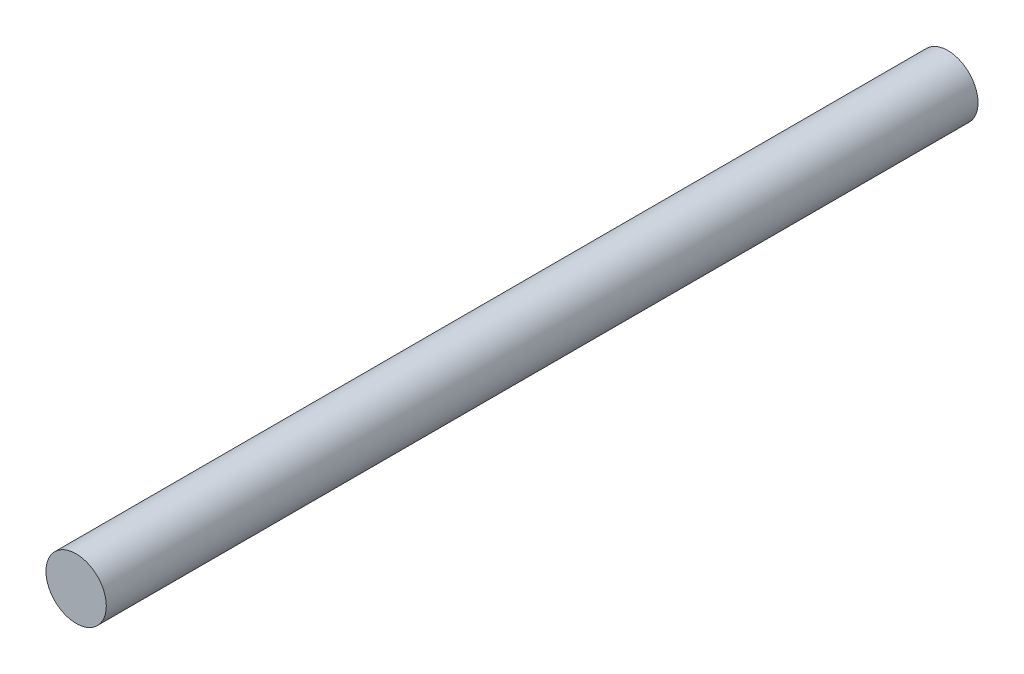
ISO-10303-21;
HEADER;
FILE_DESCRIPTION(('STEP AP214'),'2;1');
FILE_NAME('part.step','',(''),(''),'','','');
FILE_SCHEMA(('AUTOMOTIVE_DESIGN { 1 0 10303 214 1 1 1 1 }'));
ENDSEC;
DATA;
#1=APPLICATION_CONTEXT('core data for automotive mechanical design processes');
#2=APPLICATION_PROTOCOL_DEFINITION('international standard','automotive_design',2000,#1);
#3=PRODUCT_CONTEXT('',#1,'mechanical');
#4=PRODUCT('Part','Part','',(#3));
#5=PRODUCT_RELATED_PRODUCT_CATEGORY('part','',(#4));
#6=PRODUCT_DEFINITION_FORMATION('','',#4);
#7=PRODUCT_DEFINITION_CONTEXT('part definition',#1,'design');
#8=PRODUCT_DEFINITION('design','',#6,#7);
#9=PRODUCT_DEFINITION_SHAPE('','',#8);
#10=(LENGTH_UNIT() NAMED_UNIT(*) SI_UNIT(.MILLI.,.METRE.));
#11=(NAMED_UNIT(*) PLANE_ANGLE_UNIT() SI_UNIT($,.RADIAN.));
#12=(NAMED_UNIT(*) SI_UNIT($,.STERADIAN.) SOLID_ANGLE_UNIT());
#13=UNCERTAINTY_MEASURE_WITH_UNIT(LENGTH_MEASURE(1.E-05),#10,'distance_accuracy_value','');
#14=(GEOMETRIC_REPRESENTATION_CONTEXT(3) GLOBAL_UNCERTAINTY_ASSIGNED_CONTEXT((#13)) GLOBAL_UNIT_ASSIGNED_CONTEXT((#10,
#11,#12)) REPRESENTATION_CONTEXT('',''));
#15=CARTESIAN_POINT('',(0.,0.,0.));
#16=DIRECTION('',(0.,0.,1.));
#17=DIRECTION('',(1.,0.,0.));
#18=AXIS2_PLACEMENT_3D('',#15,#16,#17);
#19=CARTESIAN_POINT('',(0.,0.,39.));
#20=DIRECTION('',(0.,0.,-1.));
#21=DIRECTION('',(-1.,0.,0.));
#22=AXIS2_PLACEMENT_3D('',#19,#20,#21);
#23=CYLINDRICAL_SURFACE('',#22,1.35);
#24=CARTESIAN_POINT('',(0.,0.,39.));
#25=DIRECTION('',(0.,0.,1.));
#26=DIRECTION('',(1.,0.,0.));
#27=AXIS2_PLACEMENT_3D('',#24,#25,#26);
#28=CIRCLE('',#27,1.35);
#29=CARTESIAN_POINT('',(1.35,0.,39.));
#30=VERTEX_POINT('',#29);
#31=EDGE_CURVE('E10',#30,#30,#28,.T.);
#32=ORIENTED_EDGE('',*,*,#31,.F.);
#33=EDGE_LOOP('',(#32));
#34=FACE_BOUND('',#33,.T.);
#35=CARTESIAN_POINT('',(0.,0.,0.));
#36=DIRECTION('',(0.,0.,1.));
#37=DIRECTION('',(1.,0.,0.));
#38=AXIS2_PLACEMENT_3D('',#35,#36,#37);
#39=CIRCLE('',#38,1.35);
#40=CARTESIAN_POINT('',(1.35,0.,0.));
#41=VERTEX_POINT('',#40);
#42=EDGE_CURVE('E40',#41,#41,#39,.T.);
#43=ORIENTED_EDGE('',*,*,#42,.T.);
#44=EDGE_LOOP('',(#43));
#45=FACE_BOUND('',#44,.T.);
#46=ADVANCED_FACE('F37',(#34,#45),#23,.T.);
#47=CARTESIAN_POINT('',(0.,0.,39.));
#48=DIRECTION('',(0.,0.,1.));
#49=DIRECTION('',(1.,0.,0.));
#50=AXIS2_PLACEMENT_3D('',#47,#48,#49);
#51=PLANE('',#50);
#52=ORIENTED_EDGE('',*,*,#31,.T.);
#53=EDGE_LOOP('',(#52));
#54=FACE_BOUND('',#53,.T.);
#55=ADVANCED_FACE('F54',(#54),#51,.T.);
#56=CARTESIAN_POINT('',(0.,0.,0.));
#57=DIRECTION('',(0.,0.,1.));
#58=DIRECTION('',(1.,0.,0.));
#59=AXIS2_PLACEMENT_3D('',#56,#57,#58);
#60=PLANE('',#59);
#61=ORIENTED_EDGE('',*,*,#42,.F.);
#62=EDGE_LOOP('',(#61));
#63=FACE_BOUND('',#62,.T.);
#64=ADVANCED_FACE('F52',(#63),#60,.F.);
#65=CLOSED_SHELL('',(#46,#55,#64));
#66=MANIFOLD_SOLID_BREP('B2',#65);
#67=ADVANCED_BREP_SHAPE_REPRESENTATION('',(#18,#66),#14);
#68=SHAPE_DEFINITION_REPRESENTATION(#9,#67);
ENDSEC;
END-ISO-10303-21;
